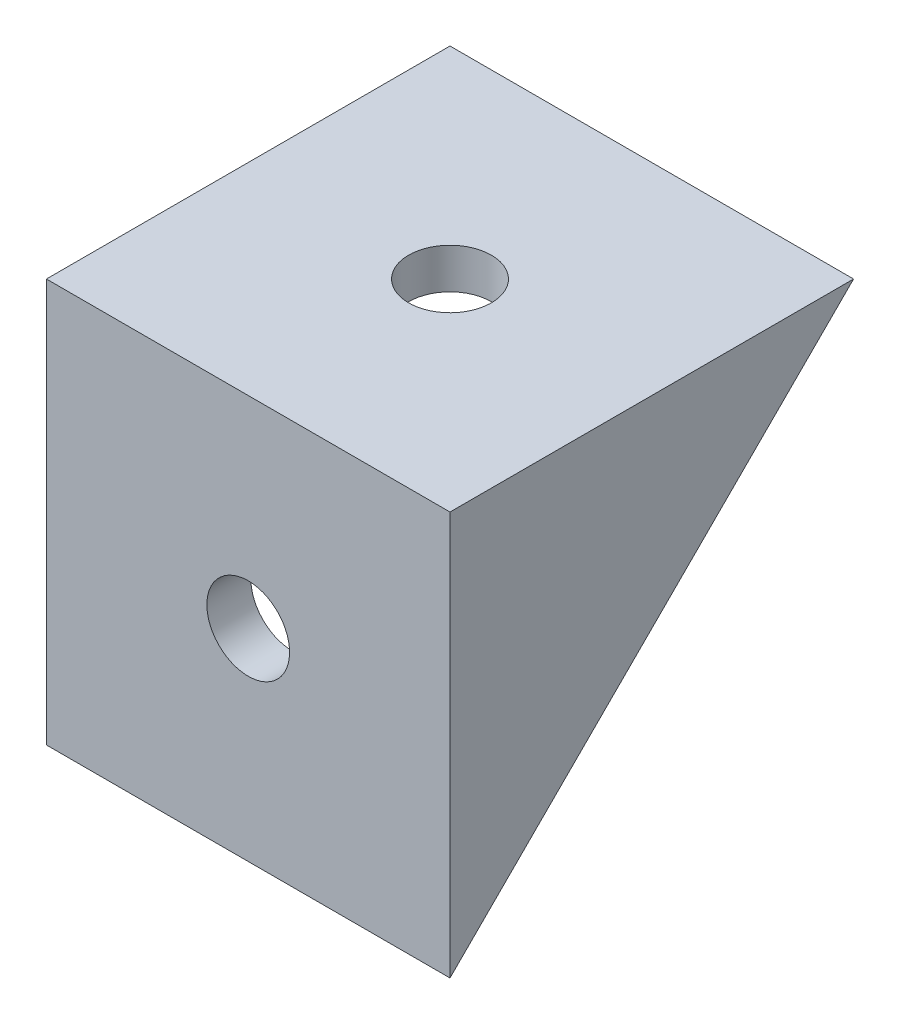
from build123d import *

# Parameters (mm, degrees)
AUFSATZ_LINEAR_AUSTRAGEN1_DEPTH = 20
SKIZZE2_W                       = 45.553500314
SKIZZE2_H                       = 46.575258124
SCHNITT_LINEAR_AUSTRAGEN1_DEPTH = 15
SKIZZE3_R                       = 4.1
SCHNITT_LINEAR_AUSTRAGEN2_DEPTH = 30
SKIZZE4_R                       = 4.1
SCHNITT_LINEAR_AUSTRAGEN3_DEPTH = 30


with BuildPart() as part:
    # Skizze1 → Aufsatz-Linear austragen1 (new, symmetric)
    with BuildSketch(Plane(origin=(0, 0, 0), x_dir=(0, 0, -1), z_dir=(1, 0, 0))):
        Polygon((40, 0), (0, -40), (0, 0), align=None)
    extrude(amount=AUFSATZ_LINEAR_AUSTRAGEN1_DEPTH, both=True)

    # Skizze2 → Schnitt-Linear austragen1 (cut, symmetric)
    with BuildSketch(Plane(origin=(0, 0, 0), x_dir=(0, 0, -1), z_dir=(1, 0, 0))):
        with Locations((27.139839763, -27.287629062)):
            Rectangle(SKIZZE2_W, SKIZZE2_H)
    extrude(amount=SCHNITT_LINEAR_AUSTRAGEN1_DEPTH, both=True, mode=Mode.SUBTRACT)

    # Skizze3 → Schnitt-Linear austragen2 (cut)
    with BuildSketch(Plane(origin=(0, 0, -4.363089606), x_dir=(-1, 0, 0), z_dir=(0, 0, -1))):
        with Locations(Location((0, -20, 0), (0, 0, 90))):
            Circle(SKIZZE3_R)
    extrude(amount=-SCHNITT_LINEAR_AUSTRAGEN2_DEPTH, mode=Mode.SUBTRACT)

    # Skizze4 → Schnitt-Linear austragen3 (cut)
    with BuildSketch(Plane.XZ.offset(4)):
        with Locations(Location((0, -20, 0), (0, 0, 270))):
            Circle(SKIZZE4_R)
    extrude(amount=-SCHNITT_LINEAR_AUSTRAGEN3_DEPTH, mode=Mode.SUBTRACT)


solid = part.part
